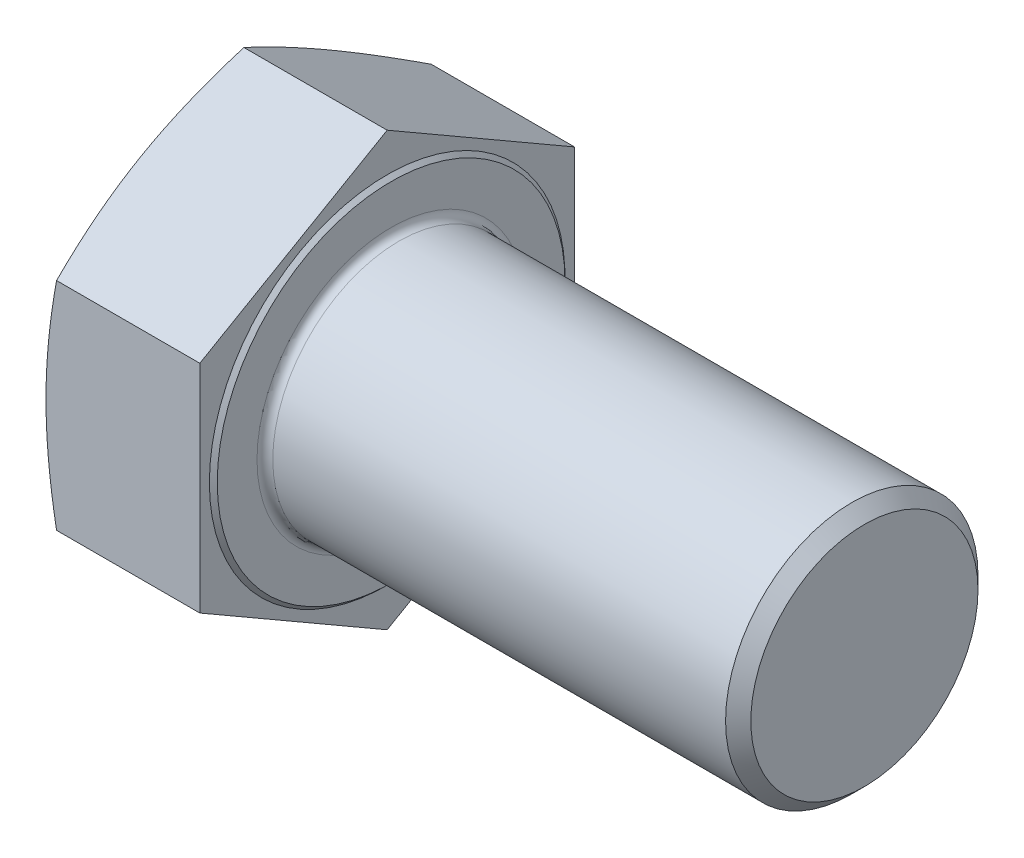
ISO-10303-21;
HEADER;
FILE_DESCRIPTION(('STEP AP214'),'2;1');
FILE_NAME('part.step','',(''),(''),'','','');
FILE_SCHEMA(('AUTOMOTIVE_DESIGN { 1 0 10303 214 1 1 1 1 }'));
ENDSEC;
DATA;
#1=APPLICATION_CONTEXT('core data for automotive mechanical design processes');
#2=APPLICATION_PROTOCOL_DEFINITION('international standard','automotive_design',2000,#1);
#3=PRODUCT_CONTEXT('',#1,'mechanical');
#4=PRODUCT('Part','Part','',(#3));
#5=PRODUCT_RELATED_PRODUCT_CATEGORY('part','',(#4));
#6=PRODUCT_DEFINITION_FORMATION('','',#4);
#7=PRODUCT_DEFINITION_CONTEXT('part definition',#1,'design');
#8=PRODUCT_DEFINITION('design','',#6,#7);
#9=PRODUCT_DEFINITION_SHAPE('','',#8);
#10=(LENGTH_UNIT() NAMED_UNIT(*) SI_UNIT(.MILLI.,.METRE.));
#11=(NAMED_UNIT(*) PLANE_ANGLE_UNIT() SI_UNIT($,.RADIAN.));
#12=(NAMED_UNIT(*) SI_UNIT($,.STERADIAN.) SOLID_ANGLE_UNIT());
#13=UNCERTAINTY_MEASURE_WITH_UNIT(LENGTH_MEASURE(1.E-05),#10,'distance_accuracy_value','');
#14=(GEOMETRIC_REPRESENTATION_CONTEXT(3) GLOBAL_UNCERTAINTY_ASSIGNED_CONTEXT((#13)) GLOBAL_UNIT_ASSIGNED_CONTEXT((#10,
#11,#12)) REPRESENTATION_CONTEXT('',''));
#15=CARTESIAN_POINT('',(0.,0.,0.));
#16=DIRECTION('',(0.,0.,1.));
#17=DIRECTION('',(1.,0.,0.));
#18=AXIS2_PLACEMENT_3D('',#15,#16,#17);
#19=CARTESIAN_POINT('',(40.,-82.2724133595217,-47.5));
#20=DIRECTION('',(1.,0.,0.));
#21=DIRECTION('',(0.,0.,-1.));
#22=AXIS2_PLACEMENT_3D('',#19,#20,#21);
#23=PLANE('',#22);
#24=CARTESIAN_POINT('',(40.,0.,0.));
#25=DIRECTION('',(1.,0.,0.));
#26=DIRECTION('',(0.,0.,-1.));
#27=AXIS2_PLACEMENT_3D('',#24,#25,#26);
#28=CIRCLE('',#27,34.);
#29=CARTESIAN_POINT('',(40.,0.,-34.));
#30=VERTEX_POINT('',#29);
#31=EDGE_CURVE('E11',#30,#30,#28,.F.);
#32=ORIENTED_EDGE('',*,*,#31,.T.);
#33=EDGE_LOOP('',(#32));
#34=FACE_BOUND('',#33,.T.);
#35=CARTESIAN_POINT('',(40.,0.,0.));
#36=DIRECTION('',(-1.,0.,0.));
#37=DIRECTION('',(0.,0.,1.));
#38=AXIS2_PLACEMENT_3D('',#35,#36,#37);
#39=CIRCLE('',#38,44.08);
#40=CARTESIAN_POINT('',(40.,0.,44.08));
#41=VERTEX_POINT('',#40);
#42=EDGE_CURVE('E257',#41,#41,#39,.T.);
#43=ORIENTED_EDGE('',*,*,#42,.F.);
#44=EDGE_LOOP('',(#43));
#45=FACE_BOUND('',#44,.T.);
#46=ADVANCED_FACE('F32',(#34,#45),#23,.T.);
#47=CARTESIAN_POINT('',(40.,-27.4241377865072,47.5));
#48=DIRECTION('',(0.,0.866025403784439,-0.5));
#49=DIRECTION('',(0.,0.5,0.866025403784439));
#50=AXIS2_PLACEMENT_3D('',#47,#48,#49);
#51=PLANE('',#50);
#52=CARTESIAN_POINT('',(2.67459560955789,-54.8483910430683,-0.000199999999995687));
#53=CARTESIAN_POINT('',(2.46789812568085,-54.2804811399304,0.983448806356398));
#54=CARTESIAN_POINT('',(2.27050260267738,-53.7117047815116,1.96859835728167));
#55=CARTESIAN_POINT('',(1.89634764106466,-52.5724052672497,3.94192300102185));
#56=CARTESIAN_POINT('',(1.71959016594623,-52.0018819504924,4.93009837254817));
#57=CARTESIAN_POINT('',(1.38865728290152,-50.8587464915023,6.91006706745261));
#58=CARTESIAN_POINT('',(1.2344992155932,-50.2861330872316,7.90186257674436));
#59=CARTESIAN_POINT('',(0.950972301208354,-49.1393836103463,9.88809093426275));
#60=CARTESIAN_POINT('',(0.821602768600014,-48.5652475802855,10.882523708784));
#61=CARTESIAN_POINT('',(0.590651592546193,-47.4210419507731,12.8643459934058));
#62=CARTESIAN_POINT('',(0.488819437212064,-46.8509850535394,13.8517135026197));
#63=CARTESIAN_POINT('',(0.31296658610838,-45.7097910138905,15.8283195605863));
#64=CARTESIAN_POINT('',(0.238946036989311,-45.1386538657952,16.8175581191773));
#65=CARTESIAN_POINT('',(0.120003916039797,-43.9958275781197,18.7969913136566));
#66=CARTESIAN_POINT('',(0.0750717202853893,-43.4241387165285,19.7871854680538));
#67=CARTESIAN_POINT('',(0.0150698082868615,-42.2803687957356,21.7682530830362));
#68=CARTESIAN_POINT('',(0.,-41.7082877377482,22.7591265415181));
#69=CARTESIAN_POINT('',(0.,-40.5641256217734,24.7408734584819));
#70=CARTESIAN_POINT('',(0.0150698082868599,-39.992044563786,25.7317469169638));
#71=CARTESIAN_POINT('',(0.0750717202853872,-38.8482746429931,27.7128145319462));
#72=CARTESIAN_POINT('',(0.120003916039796,-38.2765857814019,28.7030086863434));
#73=CARTESIAN_POINT('',(0.238946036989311,-37.1337594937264,30.6824418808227));
#74=CARTESIAN_POINT('',(0.312966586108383,-36.5626223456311,31.6716804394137));
#75=CARTESIAN_POINT('',(0.488819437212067,-35.4214283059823,33.6482864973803));
#76=CARTESIAN_POINT('',(0.590651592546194,-34.8513714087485,34.6356540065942));
#77=CARTESIAN_POINT('',(0.821602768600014,-33.7071657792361,36.617476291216));
#78=CARTESIAN_POINT('',(0.950972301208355,-33.1330297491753,37.6119090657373));
#79=CARTESIAN_POINT('',(1.2344992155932,-31.98628027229,39.5981374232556));
#80=CARTESIAN_POINT('',(1.38865728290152,-31.4136668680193,40.5899329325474));
#81=CARTESIAN_POINT('',(1.71959016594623,-30.2705314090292,42.5699016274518));
#82=CARTESIAN_POINT('',(1.89634764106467,-29.7000080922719,43.5580769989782));
#83=CARTESIAN_POINT('',(2.27050260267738,-28.56070857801,45.5314016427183));
#84=CARTESIAN_POINT('',(2.46789812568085,-27.9919322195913,46.5165511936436));
#85=CARTESIAN_POINT('',(2.67459560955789,-27.4240223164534,47.5002));
#86=B_SPLINE_CURVE_WITH_KNOTS('',3,(#52,#53,#54,#55,#56,#57,#58,#59,#60,#61,#62,#63,#64,#65,#66,
#67,#68,#69,#70,#71,#72,#73,#74,#75,#76,#77,#78,#79,#80,#81,#82,#83,#84,#85),.UNSPECIFIED.,.F.,
.F.,(4,2,2,2,2,2,2,2,2,2,2,2,2,2,2,2,4),(0.,3.46344234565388,6.92721393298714,10.3936295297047,
13.8599492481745,17.2935848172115,20.7272384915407,24.1596373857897,27.5920257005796,
31.0244140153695,34.4568129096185,37.8904665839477,41.3241021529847,44.7904218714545,
48.256837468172,51.7206090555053,55.1840514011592),.UNSPECIFIED.);
#87=CARTESIAN_POINT('',(2.67455358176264,-54.8482755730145,0.));
#88=VERTEX_POINT('',#87);
#89=CARTESIAN_POINT('',(0.,-41.1362066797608,23.75));
#90=VERTEX_POINT('',#89);
#91=EDGE_CURVE('E276',#88,#90,#86,.T.);
#92=ORIENTED_EDGE('',*,*,#91,.F.);
#93=DIRECTION('',(-1.,0.,0.));
#94=VECTOR('',#93,1.);
#95=CARTESIAN_POINT('',(40.,-54.8482755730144,0.));
#96=LINE('',#95,#94);
#97=CARTESIAN_POINT('',(39.,-54.8482755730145,0.));
#98=VERTEX_POINT('',#97);
#99=EDGE_CURVE('E142',#98,#88,#96,.T.);
#100=ORIENTED_EDGE('',*,*,#99,.F.);
#101=DIRECTION('',(0.,-0.5,-0.866025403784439));
#102=VECTOR('',#101,1.);
#103=CARTESIAN_POINT('',(39.,-27.4241377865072,47.5));
#104=LINE('',#103,#102);
#105=CARTESIAN_POINT('',(39.,-27.4241377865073,47.5));
#106=VERTEX_POINT('',#105);
#107=EDGE_CURVE('E133',#106,#98,#104,.T.);
#108=ORIENTED_EDGE('',*,*,#107,.F.);
#109=DIRECTION('',(-1.,0.,0.));
#110=VECTOR('',#109,1.);
#111=CARTESIAN_POINT('',(40.,-27.4241377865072,47.5));
#112=LINE('',#111,#110);
#113=CARTESIAN_POINT('',(2.67455358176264,-27.4241377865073,47.5));
#114=VERTEX_POINT('',#113);
#115=EDGE_CURVE('E128',#106,#114,#112,.T.);
#116=ORIENTED_EDGE('',*,*,#115,.T.);
#117=EDGE_CURVE('E121',#90,#114,#86,.T.);
#118=ORIENTED_EDGE('',*,*,#117,.F.);
#119=EDGE_LOOP('',(#92,#100,#108,#116,#118));
#120=FACE_BOUND('',#119,.T.);
#121=ADVANCED_FACE('F34',(#120),#51,.F.);
#122=CARTESIAN_POINT('',(40.,-54.8482755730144,0.));
#123=DIRECTION('',(0.,0.866025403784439,0.5));
#124=DIRECTION('',(0.,-0.5,0.866025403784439));
#125=AXIS2_PLACEMENT_3D('',#122,#123,#124);
#126=PLANE('',#125);
#127=CARTESIAN_POINT('',(2.6745956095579,-27.4240223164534,-47.5002));
#128=CARTESIAN_POINT('',(2.46789812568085,-27.9919322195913,-46.5165511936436));
#129=CARTESIAN_POINT('',(2.27050260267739,-28.5607085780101,-45.5314016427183));
#130=CARTESIAN_POINT('',(1.89634764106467,-29.700008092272,-43.5580769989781));
#131=CARTESIAN_POINT('',(1.71959016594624,-30.2705314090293,-42.5699016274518));
#132=CARTESIAN_POINT('',(1.38865728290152,-31.4136668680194,-40.5899329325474));
#133=CARTESIAN_POINT('',(1.2344992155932,-31.98628027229,-39.5981374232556));
#134=CARTESIAN_POINT('',(0.950972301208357,-33.1330297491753,-37.6119090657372));
#135=CARTESIAN_POINT('',(0.821602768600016,-33.7071657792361,-36.617476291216));
#136=CARTESIAN_POINT('',(0.590651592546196,-34.8513714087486,-34.6356540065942));
#137=CARTESIAN_POINT('',(0.488819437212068,-35.4214283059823,-33.6482864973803));
#138=CARTESIAN_POINT('',(0.312966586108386,-36.5626223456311,-31.6716804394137));
#139=CARTESIAN_POINT('',(0.238946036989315,-37.1337594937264,-30.6824418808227));
#140=CARTESIAN_POINT('',(0.1200039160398,-38.2765857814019,-28.7030086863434));
#141=CARTESIAN_POINT('',(0.0750717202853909,-38.8482746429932,-27.7128145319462));
#142=CARTESIAN_POINT('',(0.0150698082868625,-39.992044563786,-25.7317469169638));
#143=CARTESIAN_POINT('',(0.,-40.5641256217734,-24.7408734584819));
#144=CARTESIAN_POINT('',(0.,-41.7082877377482,-22.7591265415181));
#145=CARTESIAN_POINT('',(0.0150698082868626,-42.2803687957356,-21.7682530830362));
#146=CARTESIAN_POINT('',(0.0750717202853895,-43.4241387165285,-19.7871854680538));
#147=CARTESIAN_POINT('',(0.120003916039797,-43.9958275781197,-18.7969913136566));
#148=CARTESIAN_POINT('',(0.238946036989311,-45.1386538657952,-16.8175581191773));
#149=CARTESIAN_POINT('',(0.312966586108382,-45.7097910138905,-15.8283195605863));
#150=CARTESIAN_POINT('',(0.488819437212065,-46.8509850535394,-13.8517135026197));
#151=CARTESIAN_POINT('',(0.590651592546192,-47.4210419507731,-12.8643459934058));
#152=CARTESIAN_POINT('',(0.82160276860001,-48.5652475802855,-10.882523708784));
#153=CARTESIAN_POINT('',(0.950972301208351,-49.1393836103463,-9.88809093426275));
#154=CARTESIAN_POINT('',(1.23449921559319,-50.2861330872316,-7.90186257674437));
#155=CARTESIAN_POINT('',(1.38865728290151,-50.8587464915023,-6.91006706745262));
#156=CARTESIAN_POINT('',(1.71959016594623,-52.0018819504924,-4.93009837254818));
#157=CARTESIAN_POINT('',(1.89634764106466,-52.5724052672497,-3.94192300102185));
#158=CARTESIAN_POINT('',(2.27050260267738,-53.7117047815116,-1.96859835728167));
#159=CARTESIAN_POINT('',(2.46789812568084,-54.2804811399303,-0.983448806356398));
#160=CARTESIAN_POINT('',(2.67459560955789,-54.8483910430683,0.000199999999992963));
#161=B_SPLINE_CURVE_WITH_KNOTS('',3,(#127,#128,#129,#130,#131,#132,#133,#134,#135,#136,#137,
#138,#139,#140,#141,#142,#143,#144,#145,#146,#147,#148,#149,#150,#151,#152,#153,#154,#155,#156,
#157,#158,#159,#160),.UNSPECIFIED.,.F.,.F.,(4,2,2,2,2,2,2,2,2,2,2,2,2,2,2,2,4),(0.,
3.46344234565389,6.92721393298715,10.3936295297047,13.8599492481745,17.2935848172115,
20.7272384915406,24.1596373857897,27.5920257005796,31.0244140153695,34.4568129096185,
37.8904665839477,41.3241021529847,44.7904218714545,48.256837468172,51.7206090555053,
55.1840514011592),.UNSPECIFIED.);
#162=CARTESIAN_POINT('',(2.67455358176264,-27.4241377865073,-47.5));
#163=VERTEX_POINT('',#162);
#164=CARTESIAN_POINT('',(0.,-41.1362066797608,-23.75));
#165=VERTEX_POINT('',#164);
#166=EDGE_CURVE('E229',#163,#165,#161,.T.);
#167=ORIENTED_EDGE('',*,*,#166,.F.);
#168=DIRECTION('',(-1.,0.,0.));
#169=VECTOR('',#168,1.);
#170=CARTESIAN_POINT('',(40.,-27.4241377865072,-47.5));
#171=LINE('',#170,#169);
#172=CARTESIAN_POINT('',(39.,-27.4241377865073,-47.5));
#173=VERTEX_POINT('',#172);
#174=EDGE_CURVE('E139',#173,#163,#171,.T.);
#175=ORIENTED_EDGE('',*,*,#174,.F.);
#176=DIRECTION('',(0.,0.5,-0.866025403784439));
#177=VECTOR('',#176,1.);
#178=CARTESIAN_POINT('',(39.,-54.8482755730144,0.));
#179=LINE('',#178,#177);
#180=EDGE_CURVE('E266',#98,#173,#179,.T.);
#181=ORIENTED_EDGE('',*,*,#180,.F.);
#182=ORIENTED_EDGE('',*,*,#99,.T.);
#183=EDGE_CURVE('E225',#165,#88,#161,.T.);
#184=ORIENTED_EDGE('',*,*,#183,.F.);
#185=EDGE_LOOP('',(#167,#175,#181,#182,#184));
#186=FACE_BOUND('',#185,.T.);
#187=ADVANCED_FACE('F180',(#186),#126,.F.);
#188=CARTESIAN_POINT('',(40.,-27.4241377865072,-47.5));
#189=DIRECTION('',(0.,0.,1.));
#190=DIRECTION('',(0.,-1.,0.));
#191=AXIS2_PLACEMENT_3D('',#188,#189,#190);
#192=PLANE('',#191);
#193=CARTESIAN_POINT('',(14.2917536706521,-72.609473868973,-47.5));
#194=CARTESIAN_POINT('',(13.9644810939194,-71.5349542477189,-47.5));
#195=CARTESIAN_POINT('',(13.6391829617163,-70.4598313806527,-47.5));
#196=CARTESIAN_POINT('',(12.9929882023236,-68.3082572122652,-47.5));
#197=CARTESIAN_POINT('',(12.6720916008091,-67.2318059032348,-47.5));
#198=CARTESIAN_POINT('',(12.0351315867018,-65.0773816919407,-47.5));
#199=CARTESIAN_POINT('',(11.7190685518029,-63.9994086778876,-47.5));
#200=CARTESIAN_POINT('',(11.0923375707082,-61.8418982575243,-47.5));
#201=CARTESIAN_POINT('',(10.7816696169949,-60.7623608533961,-47.5));
#202=CARTESIAN_POINT('',(9.85747603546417,-57.5171579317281,-47.5));
#203=CARTESIAN_POINT('',(9.25295184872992,-55.3489151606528,-47.5));
#204=CARTESIAN_POINT('',(8.07364144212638,-51.004372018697,-47.5));
#205=CARTESIAN_POINT('',(7.49885468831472,-48.8280717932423,-47.5));
#206=CARTESIAN_POINT('',(6.39326653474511,-44.4928457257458,-47.5));
#207=CARTESIAN_POINT('',(5.86201019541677,-42.3340364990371,-47.5));
#208=CARTESIAN_POINT('',(4.84472633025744,-38.0056776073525,-47.5));
#209=CARTESIAN_POINT('',(4.35869956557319,-35.8361277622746,-47.5));
#210=CARTESIAN_POINT('',(3.44320866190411,-31.4857942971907,-47.5));
#211=CARTESIAN_POINT('',(3.01372522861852,-29.3050147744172,-47.5));
#212=CARTESIAN_POINT('',(2.22439409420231,-24.9308159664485,-47.5));
#213=CARTESIAN_POINT('',(1.86454405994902,-22.737397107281,-47.5));
#214=CARTESIAN_POINT('',(1.26474387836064,-18.5848116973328,-47.5));
#215=CARTESIAN_POINT('',(1.01587422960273,-16.6269537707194,-47.5));
#216=CARTESIAN_POINT('',(0.699882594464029,-13.6840760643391,-47.5));
#217=CARTESIAN_POINT('',(0.604103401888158,-12.7020901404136,-47.5));
#218=CARTESIAN_POINT('',(0.432723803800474,-10.7363426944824,-47.5));
#219=CARTESIAN_POINT('',(0.357123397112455,-9.75258117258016,-47.5));
#220=CARTESIAN_POINT('',(0.22708251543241,-7.78434865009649,-47.5));
#221=CARTESIAN_POINT('',(0.172627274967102,-6.79987862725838,-47.5));
#222=CARTESIAN_POINT('',(0.0855050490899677,-4.82997097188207,-47.5));
#223=CARTESIAN_POINT('',(0.0528380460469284,-3.8445333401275,-47.5));
#224=CARTESIAN_POINT('',(0.00973154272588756,-1.87317368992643,-47.5));
#225=CARTESIAN_POINT('',(-0.000708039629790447,-0.887251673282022,-47.5));
#226=CARTESIAN_POINT('',(0.000782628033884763,1.08457560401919,-47.5));
#227=CARTESIAN_POINT('',(0.0127128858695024,2.07048086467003,-47.5));
#228=CARTESIAN_POINT('',(0.0588972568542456,4.04676622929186,-47.5));
#229=CARTESIAN_POINT('',(0.0932642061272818,5.03714368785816,-47.5));
#230=CARTESIAN_POINT('',(0.183965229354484,7.01688740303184,-47.5));
#231=CARTESIAN_POINT('',(0.240299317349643,8.00625365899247,-47.5));
#232=CARTESIAN_POINT('',(0.374203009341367,9.98356021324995,-47.5));
#233=CARTESIAN_POINT('',(0.451772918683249,10.9715004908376,-47.5));
#234=CARTESIAN_POINT('',(0.627184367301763,12.9455599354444,-47.5));
#235=CARTESIAN_POINT('',(0.725025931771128,13.9316791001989,-47.5));
#236=CARTESIAN_POINT('',(1.0474838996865,16.8885587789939,-47.5));
#237=CARTESIAN_POINT('',(1.30092205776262,18.8562442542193,-47.5));
#238=CARTESIAN_POINT('',(1.73104906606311,21.8002454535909,-47.5));
#239=CARTESIAN_POINT('',(1.88275591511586,22.780340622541,-47.5));
#240=CARTESIAN_POINT('',(2.20151918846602,24.7380474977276,-47.5));
#241=CARTESIAN_POINT('',(2.36857571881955,25.7156591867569,-47.5));
#242=CARTESIAN_POINT('',(2.90923921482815,28.7479678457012,-47.5));
#243=CARTESIAN_POINT('',(3.30698744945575,30.7983780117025,-47.5));
#244=CARTESIAN_POINT('',(4.15366697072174,34.8886319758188,-47.5));
#245=CARTESIAN_POINT('',(4.6026021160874,36.9284749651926,-47.5));
#246=CARTESIAN_POINT('',(5.54223962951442,40.9990953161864,-47.5));
#247=CARTESIAN_POINT('',(6.03295412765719,43.0298698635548,-47.5));
#248=CARTESIAN_POINT('',(7.04816495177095,47.0828615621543,-47.5));
#249=CARTESIAN_POINT('',(7.5726604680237,49.1050789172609,-47.5));
#250=CARTESIAN_POINT('',(8.64981077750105,53.1447558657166,-47.5));
#251=CARTESIAN_POINT('',(9.20250086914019,55.1622060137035,-47.5));
#252=CARTESIAN_POINT('',(10.3303638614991,59.1908031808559,-47.5));
#253=CARTESIAN_POINT('',(10.9055368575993,61.2019501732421,-47.5));
#254=CARTESIAN_POINT('',(12.074250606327,65.2185225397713,-47.5));
#255=CARTESIAN_POINT('',(12.6677882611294,67.2239488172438,-47.5));
#256=CARTESIAN_POINT('',(13.870132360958,71.2302065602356,-47.5));
#257=CARTESIAN_POINT('',(14.4789387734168,73.2310380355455,-47.5));
#258=CARTESIAN_POINT('',(15.7024853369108,77.2067106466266,-47.5));
#259=CARTESIAN_POINT('',(16.3170857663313,79.1815948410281,-47.5));
#260=CARTESIAN_POINT('',(17.5567558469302,83.1280715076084,-47.5));
#261=CARTESIAN_POINT('',(18.1818254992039,85.0996639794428,-47.5));
#262=CARTESIAN_POINT('',(19.4408617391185,89.0401033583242,-47.5));
#263=CARTESIAN_POINT('',(20.0748287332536,91.0089501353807,-47.5));
#264=CARTESIAN_POINT('',(21.3503275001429,94.9441922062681,-47.5));
#265=CARTESIAN_POINT('',(21.9918592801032,96.9105874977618,-47.5));
#266=CARTESIAN_POINT('',(23.2789683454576,100.833786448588,-47.5));
#267=CARTESIAN_POINT('',(23.9245210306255,102.790598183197,-47.5));
#268=CARTESIAN_POINT('',(25.2211970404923,106.702375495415,-47.5));
#269=CARTESIAN_POINT('',(25.8723203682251,108.657341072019,-47.5));
#270=CARTESIAN_POINT('',(27.1793499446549,112.565494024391,-47.5));
#271=CARTESIAN_POINT('',(27.8352557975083,114.518681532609,-47.5));
#272=CARTESIAN_POINT('',(29.1513116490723,118.423621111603,-47.5));
#273=CARTESIAN_POINT('',(29.8114616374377,120.375373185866,-47.5));
#274=CARTESIAN_POINT('',(30.4734395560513,122.32650357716,-47.5));
#275=B_SPLINE_CURVE_WITH_KNOTS('',3,(#193,#194,#195,#196,#197,#198,#199,#200,#201,#202,#203,
#204,#205,#206,#207,#208,#209,#210,#211,#212,#213,#214,#215,#216,#217,#218,#219,#220,#221,#222,
#223,#224,#225,#226,#227,#228,#229,#230,#231,#232,#233,#234,#235,#236,#237,#238,#239,#240,#241,
#242,#243,#244,#245,#246,#247,#248,#249,#250,#251,#252,#253,#254,#255,#256,#257,#258,#259,#260,
#261,#262,#263,#264,#265,#266,#267,#268,#269,#270,#271,#272,#273,#274),.UNSPECIFIED.,.F.,.F.,(4,
2,2,2,2,2,2,2,2,2,2,2,2,2,2,2,2,2,2,2,2,2,2,2,2,2,2,2,2,2,2,2,2,2,2,2,2,2,2,2,4),(0.,
3.36976291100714,6.73954547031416,10.1095900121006,13.4796298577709,20.2322684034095,
26.9847856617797,33.654047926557,40.3234224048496,46.9905151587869,53.6573844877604,
59.5767707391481,62.5365332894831,65.4962956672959,68.4539875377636,71.4116770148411,
74.3693555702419,77.3270351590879,80.299704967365,83.2723766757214,86.2450911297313,
89.2178092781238,95.168045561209,98.1432608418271,101.118496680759,107.383502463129,
113.648980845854,119.916284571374,126.183438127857,132.458640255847,138.73386900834,
145.00804493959,151.282207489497,157.487099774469,163.69199270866,169.897170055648,
176.102353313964,182.283982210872,188.465614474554,194.646740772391,200.827852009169),.UNSPECIFIED.);
#276=CARTESIAN_POINT('',(2.67455358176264,27.4241377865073,-47.5));
#277=VERTEX_POINT('',#276);
#278=CARTESIAN_POINT('',(0.,0.,-47.5));
#279=VERTEX_POINT('',#278);
#280=EDGE_CURVE('E292',#277,#279,#275,.F.);
#281=ORIENTED_EDGE('',*,*,#280,.F.);
#282=DIRECTION('',(-1.,0.,0.));
#283=VECTOR('',#282,1.);
#284=CARTESIAN_POINT('',(40.,27.4241377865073,-47.5));
#285=LINE('',#284,#283);
#286=CARTESIAN_POINT('',(39.,27.4241377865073,-47.5));
#287=VERTEX_POINT('',#286);
#288=EDGE_CURVE('E130',#287,#277,#285,.T.);
#289=ORIENTED_EDGE('',*,*,#288,.F.);
#290=DIRECTION('',(0.,1.,0.));
#291=VECTOR('',#290,1.);
#292=CARTESIAN_POINT('',(39.,-27.4241377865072,-47.5));
#293=LINE('',#292,#291);
#294=EDGE_CURVE('E259',#173,#287,#293,.T.);
#295=ORIENTED_EDGE('',*,*,#294,.F.);
#296=ORIENTED_EDGE('',*,*,#174,.T.);
#297=EDGE_CURVE('E230',#279,#163,#275,.F.);
#298=ORIENTED_EDGE('',*,*,#297,.F.);
#299=EDGE_LOOP('',(#281,#289,#295,#296,#298));
#300=FACE_BOUND('',#299,.T.);
#301=ADVANCED_FACE('F238',(#300),#192,.F.);
#302=CARTESIAN_POINT('',(40.,27.4241377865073,-47.5));
#303=DIRECTION('',(0.,-0.866025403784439,0.5));
#304=DIRECTION('',(0.,-0.5,-0.866025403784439));
#305=AXIS2_PLACEMENT_3D('',#302,#303,#304);
#306=PLANE('',#305);
#307=CARTESIAN_POINT('',(2.67459560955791,54.8483910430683,0.000199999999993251));
#308=CARTESIAN_POINT('',(2.46789812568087,54.2804811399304,-0.983448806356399));
#309=CARTESIAN_POINT('',(2.2705026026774,53.7117047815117,-1.96859835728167));
#310=CARTESIAN_POINT('',(1.89634764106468,52.5724052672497,-3.94192300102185));
#311=CARTESIAN_POINT('',(1.71959016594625,52.0018819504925,-4.93009837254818));
#312=CARTESIAN_POINT('',(1.38865728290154,50.8587464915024,-6.91006706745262));
#313=CARTESIAN_POINT('',(1.23449921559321,50.2861330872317,-7.90186257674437));
#314=CARTESIAN_POINT('',(0.950972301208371,49.1393836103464,-9.88809093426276));
#315=CARTESIAN_POINT('',(0.821602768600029,48.5652475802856,-10.882523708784));
#316=CARTESIAN_POINT('',(0.59065159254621,47.4210419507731,-12.8643459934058));
#317=CARTESIAN_POINT('',(0.488819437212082,46.8509850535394,-13.8517135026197));
#318=CARTESIAN_POINT('',(0.312966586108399,45.7097910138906,-15.8283195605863));
#319=CARTESIAN_POINT('',(0.238946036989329,45.1386538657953,-16.8175581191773));
#320=CARTESIAN_POINT('',(0.120003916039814,43.9958275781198,-18.7969913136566));
#321=CARTESIAN_POINT('',(0.0750717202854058,43.4241387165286,-19.7871854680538));
#322=CARTESIAN_POINT('',(0.0150698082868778,42.2803687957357,-21.7682530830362));
#323=CARTESIAN_POINT('',(0.,41.7082877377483,-22.7591265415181));
#324=CARTESIAN_POINT('',(0.,40.5641256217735,-24.7408734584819));
#325=CARTESIAN_POINT('',(0.0150698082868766,39.9920445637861,-25.7317469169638));
#326=CARTESIAN_POINT('',(0.0750717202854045,38.8482746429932,-27.7128145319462));
#327=CARTESIAN_POINT('',(0.120003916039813,38.276585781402,-28.7030086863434));
#328=CARTESIAN_POINT('',(0.238946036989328,37.1337594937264,-30.6824418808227));
#329=CARTESIAN_POINT('',(0.312966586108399,36.5626223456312,-31.6716804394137));
#330=CARTESIAN_POINT('',(0.488819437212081,35.4214283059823,-33.6482864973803));
#331=CARTESIAN_POINT('',(0.590651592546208,34.8513714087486,-34.6356540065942));
#332=CARTESIAN_POINT('',(0.821602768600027,33.7071657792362,-36.617476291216));
#333=CARTESIAN_POINT('',(0.950972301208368,33.1330297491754,-37.6119090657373));
#334=CARTESIAN_POINT('',(1.23449921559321,31.98628027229,-39.5981374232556));
#335=CARTESIAN_POINT('',(1.38865728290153,31.4136668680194,-40.5899329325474));
#336=CARTESIAN_POINT('',(1.71959016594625,30.2705314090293,-42.5699016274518));
#337=CARTESIAN_POINT('',(1.89634764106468,29.700008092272,-43.5580769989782));
#338=CARTESIAN_POINT('',(2.27050260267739,28.5607085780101,-45.5314016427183));
#339=CARTESIAN_POINT('',(2.46789812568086,27.9919322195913,-46.5165511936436));
#340=CARTESIAN_POINT('',(2.6745956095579,27.4240223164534,-47.5002));
#341=B_SPLINE_CURVE_WITH_KNOTS('',3,(#307,#308,#309,#310,#311,#312,#313,#314,#315,#316,#317,
#318,#319,#320,#321,#322,#323,#324,#325,#326,#327,#328,#329,#330,#331,#332,#333,#334,#335,#336,
#337,#338,#339,#340),.UNSPECIFIED.,.F.,.F.,(4,2,2,2,2,2,2,2,2,2,2,2,2,2,2,2,4),(0.,
3.46344234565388,6.92721393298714,10.3936295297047,13.8599492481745,17.2935848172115,
20.7272384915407,24.1596373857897,27.5920257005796,31.0244140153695,34.4568129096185,
37.8904665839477,41.3241021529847,44.7904218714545,48.256837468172,51.7206090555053,
55.1840514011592),.UNSPECIFIED.);
#342=CARTESIAN_POINT('',(2.67455358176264,54.8482755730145,0.));
#343=VERTEX_POINT('',#342);
#344=CARTESIAN_POINT('',(0.,41.1362066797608,-23.75));
#345=VERTEX_POINT('',#344);
#346=EDGE_CURVE('E48',#343,#345,#341,.T.);
#347=ORIENTED_EDGE('',*,*,#346,.F.);
#348=DIRECTION('',(-1.,0.,0.));
#349=VECTOR('',#348,1.);
#350=CARTESIAN_POINT('',(40.,54.8482755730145,0.));
#351=LINE('',#350,#349);
#352=CARTESIAN_POINT('',(39.,54.8482755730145,0.));
#353=VERTEX_POINT('',#352);
#354=EDGE_CURVE('E127',#353,#343,#351,.T.);
#355=ORIENTED_EDGE('',*,*,#354,.F.);
#356=DIRECTION('',(0.,0.5,0.866025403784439));
#357=VECTOR('',#356,1.);
#358=CARTESIAN_POINT('',(39.,27.4241377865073,-47.5));
#359=LINE('',#358,#357);
#360=EDGE_CURVE('E256',#287,#353,#359,.T.);
#361=ORIENTED_EDGE('',*,*,#360,.F.);
#362=ORIENTED_EDGE('',*,*,#288,.T.);
#363=EDGE_CURVE('E253',#345,#277,#341,.T.);
#364=ORIENTED_EDGE('',*,*,#363,.F.);
#365=EDGE_LOOP('',(#347,#355,#361,#362,#364));
#366=FACE_BOUND('',#365,.T.);
#367=ADVANCED_FACE('F242',(#366),#306,.F.);
#368=CARTESIAN_POINT('',(40.,54.8482755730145,0.));
#369=DIRECTION('',(0.,-0.866025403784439,-0.5));
#370=DIRECTION('',(0.,0.5,-0.866025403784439));
#371=AXIS2_PLACEMENT_3D('',#368,#369,#370);
#372=PLANE('',#371);
#373=CARTESIAN_POINT('',(2.67459560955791,27.4240223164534,47.5002));
#374=CARTESIAN_POINT('',(2.46789812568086,27.9919322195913,46.5165511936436));
#375=CARTESIAN_POINT('',(2.2705026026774,28.5607085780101,45.5314016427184));
#376=CARTESIAN_POINT('',(1.89634764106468,29.700008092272,43.5580769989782));
#377=CARTESIAN_POINT('',(1.71959016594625,30.2705314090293,42.5699016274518));
#378=CARTESIAN_POINT('',(1.38865728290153,31.4136668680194,40.5899329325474));
#379=CARTESIAN_POINT('',(1.23449921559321,31.98628027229,39.5981374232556));
#380=CARTESIAN_POINT('',(0.950972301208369,33.1330297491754,37.6119090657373));
#381=CARTESIAN_POINT('',(0.821602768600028,33.7071657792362,36.617476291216));
#382=CARTESIAN_POINT('',(0.590651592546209,34.8513714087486,34.6356540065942));
#383=CARTESIAN_POINT('',(0.488819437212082,35.4214283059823,33.6482864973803));
#384=CARTESIAN_POINT('',(0.3129665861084,36.5626223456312,31.6716804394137));
#385=CARTESIAN_POINT('',(0.23894603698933,37.1337594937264,30.6824418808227));
#386=CARTESIAN_POINT('',(0.120003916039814,38.276585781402,28.7030086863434));
#387=CARTESIAN_POINT('',(0.0750717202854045,38.8482746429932,27.7128145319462));
#388=CARTESIAN_POINT('',(0.0150698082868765,39.9920445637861,25.7317469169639));
#389=CARTESIAN_POINT('',(0.,40.5641256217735,24.7408734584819));
#390=CARTESIAN_POINT('',(0.,41.7082877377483,22.7591265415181));
#391=CARTESIAN_POINT('',(0.0150698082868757,42.2803687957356,21.7682530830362));
#392=CARTESIAN_POINT('',(0.0750717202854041,43.4241387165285,19.7871854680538));
#393=CARTESIAN_POINT('',(0.120003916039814,43.9958275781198,18.7969913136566));
#394=CARTESIAN_POINT('',(0.238946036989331,45.1386538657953,16.8175581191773));
#395=CARTESIAN_POINT('',(0.3129665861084,45.7097910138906,15.8283195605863));
#396=CARTESIAN_POINT('',(0.488819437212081,46.8509850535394,13.8517135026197));
#397=CARTESIAN_POINT('',(0.590651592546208,47.4210419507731,12.8643459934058));
#398=CARTESIAN_POINT('',(0.821602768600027,48.5652475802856,10.882523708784));
#399=CARTESIAN_POINT('',(0.950972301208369,49.1393836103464,9.88809093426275));
#400=CARTESIAN_POINT('',(1.23449921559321,50.2861330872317,7.90186257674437));
#401=CARTESIAN_POINT('',(1.38865728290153,50.8587464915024,6.91006706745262));
#402=CARTESIAN_POINT('',(1.71959016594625,52.0018819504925,4.93009837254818));
#403=CARTESIAN_POINT('',(1.89634764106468,52.5724052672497,3.94192300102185));
#404=CARTESIAN_POINT('',(2.2705026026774,53.7117047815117,1.96859835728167));
#405=CARTESIAN_POINT('',(2.46789812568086,54.2804811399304,0.983448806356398));
#406=CARTESIAN_POINT('',(2.67459560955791,54.8483910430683,-0.000199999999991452));
#407=B_SPLINE_CURVE_WITH_KNOTS('',3,(#373,#374,#375,#376,#377,#378,#379,#380,#381,#382,#383,
#384,#385,#386,#387,#388,#389,#390,#391,#392,#393,#394,#395,#396,#397,#398,#399,#400,#401,#402,
#403,#404,#405,#406),.UNSPECIFIED.,.F.,.F.,(4,2,2,2,2,2,2,2,2,2,2,2,2,2,2,2,4),(0.,
3.46344234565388,6.92721393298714,10.3936295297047,13.8599492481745,17.2935848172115,
20.7272384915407,24.1596373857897,27.5920257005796,31.0244140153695,34.4568129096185,
37.8904665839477,41.3241021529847,44.7904218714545,48.256837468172,51.7206090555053,
55.1840514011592),.UNSPECIFIED.);
#408=CARTESIAN_POINT('',(2.67455358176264,27.4241377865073,47.5));
#409=VERTEX_POINT('',#408);
#410=CARTESIAN_POINT('',(0.,41.1362066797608,23.75));
#411=VERTEX_POINT('',#410);
#412=EDGE_CURVE('E56',#409,#411,#407,.T.);
#413=ORIENTED_EDGE('',*,*,#412,.F.);
#414=DIRECTION('',(-1.,0.,0.));
#415=VECTOR('',#414,1.);
#416=CARTESIAN_POINT('',(40.,27.4241377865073,47.5));
#417=LINE('',#416,#415);
#418=CARTESIAN_POINT('',(39.,27.4241377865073,47.5));
#419=VERTEX_POINT('',#418);
#420=EDGE_CURVE('E118',#419,#409,#417,.T.);
#421=ORIENTED_EDGE('',*,*,#420,.F.);
#422=DIRECTION('',(0.,-0.5,0.866025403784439));
#423=VECTOR('',#422,1.);
#424=CARTESIAN_POINT('',(39.,54.8482755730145,0.));
#425=LINE('',#424,#423);
#426=EDGE_CURVE('E254',#353,#419,#425,.T.);
#427=ORIENTED_EDGE('',*,*,#426,.F.);
#428=ORIENTED_EDGE('',*,*,#354,.T.);
#429=EDGE_CURVE('E120',#411,#343,#407,.T.);
#430=ORIENTED_EDGE('',*,*,#429,.F.);
#431=EDGE_LOOP('',(#413,#421,#427,#428,#430));
#432=FACE_BOUND('',#431,.T.);
#433=ADVANCED_FACE('F116',(#432),#372,.F.);
#434=CARTESIAN_POINT('',(40.,27.4241377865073,47.5));
#435=DIRECTION('',(0.,0.,-1.));
#436=DIRECTION('',(-1.,0.,0.));
#437=AXIS2_PLACEMENT_3D('',#434,#435,#436);
#438=PLANE('',#437);
#439=CARTESIAN_POINT('',(14.291753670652,-72.609473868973,47.5));
#440=CARTESIAN_POINT('',(13.9644810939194,-71.5349542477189,47.5));
#441=CARTESIAN_POINT('',(13.6391829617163,-70.4598313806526,47.5));
#442=CARTESIAN_POINT('',(12.9929882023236,-68.3082572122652,47.5));
#443=CARTESIAN_POINT('',(12.6720916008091,-67.2318059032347,47.5));
#444=CARTESIAN_POINT('',(12.0351315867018,-65.0773816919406,47.5));
#445=CARTESIAN_POINT('',(11.7190685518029,-63.9994086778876,47.5));
#446=CARTESIAN_POINT('',(11.0923375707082,-61.8418982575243,47.5));
#447=CARTESIAN_POINT('',(10.7816696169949,-60.7623608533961,47.5));
#448=CARTESIAN_POINT('',(9.85747603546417,-57.5171579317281,47.5));
#449=CARTESIAN_POINT('',(9.25295184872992,-55.3489151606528,47.5));
#450=CARTESIAN_POINT('',(8.07364144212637,-51.004372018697,47.5));
#451=CARTESIAN_POINT('',(7.49885468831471,-48.8280717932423,47.5));
#452=CARTESIAN_POINT('',(6.39326653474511,-44.4928457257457,47.5));
#453=CARTESIAN_POINT('',(5.86201019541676,-42.3340364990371,47.5));
#454=CARTESIAN_POINT('',(4.84472633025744,-38.0056776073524,47.5));
#455=CARTESIAN_POINT('',(4.35869956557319,-35.8361277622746,47.5));
#456=CARTESIAN_POINT('',(3.44320866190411,-31.4857942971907,47.5));
#457=CARTESIAN_POINT('',(3.01372522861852,-29.3050147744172,47.5));
#458=CARTESIAN_POINT('',(2.22439409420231,-24.9308159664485,47.5));
#459=CARTESIAN_POINT('',(1.86454405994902,-22.737397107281,47.5));
#460=CARTESIAN_POINT('',(1.26474387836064,-18.5848116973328,47.5));
#461=CARTESIAN_POINT('',(1.01587422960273,-16.6269537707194,47.5));
#462=CARTESIAN_POINT('',(0.699882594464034,-13.6840760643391,47.5));
#463=CARTESIAN_POINT('',(0.604103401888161,-12.7020901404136,47.5));
#464=CARTESIAN_POINT('',(0.432723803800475,-10.7363426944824,47.5));
#465=CARTESIAN_POINT('',(0.357123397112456,-9.75258117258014,47.5));
#466=CARTESIAN_POINT('',(0.227082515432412,-7.78434865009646,47.5));
#467=CARTESIAN_POINT('',(0.172627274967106,-6.79987862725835,47.5));
#468=CARTESIAN_POINT('',(0.0855050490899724,-4.82997097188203,47.5));
#469=CARTESIAN_POINT('',(0.0528380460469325,-3.84453334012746,47.5));
#470=CARTESIAN_POINT('',(0.0097315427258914,-1.87317368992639,47.5));
#471=CARTESIAN_POINT('',(-0.000708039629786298,-0.887251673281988,47.5));
#472=CARTESIAN_POINT('',(0.000782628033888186,1.08457560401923,47.5));
#473=CARTESIAN_POINT('',(0.0127128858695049,2.07048086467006,47.5));
#474=CARTESIAN_POINT('',(0.0588972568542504,4.0467662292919,47.5));
#475=CARTESIAN_POINT('',(0.0932642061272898,5.0371436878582,47.5));
#476=CARTESIAN_POINT('',(0.183965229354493,7.01688740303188,47.5));
#477=CARTESIAN_POINT('',(0.240299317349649,8.00625365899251,47.5));
#478=CARTESIAN_POINT('',(0.374203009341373,9.98356021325,47.5));
#479=CARTESIAN_POINT('',(0.451772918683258,10.9715004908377,47.5));
#480=CARTESIAN_POINT('',(0.627184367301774,12.9455599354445,47.5));
#481=CARTESIAN_POINT('',(0.725025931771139,13.9316791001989,47.5));
#482=CARTESIAN_POINT('',(1.04748389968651,16.888558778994,47.5));
#483=CARTESIAN_POINT('',(1.30092205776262,18.8562442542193,47.5));
#484=CARTESIAN_POINT('',(1.73104906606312,21.8002454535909,47.5));
#485=CARTESIAN_POINT('',(1.88275591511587,22.780340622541,47.5));
#486=CARTESIAN_POINT('',(2.20151918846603,24.7380474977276,47.5));
#487=CARTESIAN_POINT('',(2.36857571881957,25.7156591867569,47.5));
#488=CARTESIAN_POINT('',(2.90923921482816,28.7479678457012,47.5));
#489=CARTESIAN_POINT('',(3.30698744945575,30.7983780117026,47.5));
#490=CARTESIAN_POINT('',(4.15366697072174,34.8886319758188,47.5));
#491=CARTESIAN_POINT('',(4.60260211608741,36.9284749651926,47.5));
#492=CARTESIAN_POINT('',(5.54223962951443,40.9990953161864,47.5));
#493=CARTESIAN_POINT('',(6.0329541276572,43.0298698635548,47.5));
#494=CARTESIAN_POINT('',(7.04816495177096,47.0828615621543,47.5));
#495=CARTESIAN_POINT('',(7.5726604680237,49.1050789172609,47.5));
#496=CARTESIAN_POINT('',(8.64981077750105,53.1447558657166,47.5));
#497=CARTESIAN_POINT('',(9.20250086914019,55.1622060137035,47.5));
#498=CARTESIAN_POINT('',(10.3303638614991,59.1908031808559,47.5));
#499=CARTESIAN_POINT('',(10.9055368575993,61.2019501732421,47.5));
#500=CARTESIAN_POINT('',(12.074250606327,65.2185225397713,47.5));
#501=CARTESIAN_POINT('',(12.6677882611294,67.2239488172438,47.5));
#502=CARTESIAN_POINT('',(13.870132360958,71.2302065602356,47.5));
#503=CARTESIAN_POINT('',(14.4789387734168,73.2310380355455,47.5));
#504=CARTESIAN_POINT('',(15.7024853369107,77.2067106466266,47.5));
#505=CARTESIAN_POINT('',(16.3170857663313,79.1815948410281,47.5));
#506=CARTESIAN_POINT('',(17.5567558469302,83.1280715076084,47.5));
#507=CARTESIAN_POINT('',(18.1818254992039,85.0996639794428,47.5));
#508=CARTESIAN_POINT('',(19.4408617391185,89.0401033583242,47.5));
#509=CARTESIAN_POINT('',(20.0748287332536,91.0089501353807,47.5));
#510=CARTESIAN_POINT('',(21.3503275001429,94.9441922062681,47.5));
#511=CARTESIAN_POINT('',(21.9918592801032,96.9105874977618,47.5));
#512=CARTESIAN_POINT('',(23.2789683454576,100.833786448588,47.5));
#513=CARTESIAN_POINT('',(23.9245210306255,102.790598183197,47.5));
#514=CARTESIAN_POINT('',(25.2211970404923,106.702375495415,47.5));
#515=CARTESIAN_POINT('',(25.8723203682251,108.657341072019,47.5));
#516=CARTESIAN_POINT('',(27.1793499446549,112.565494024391,47.5));
#517=CARTESIAN_POINT('',(27.8352557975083,114.518681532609,47.5));
#518=CARTESIAN_POINT('',(29.1513116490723,118.423621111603,47.5));
#519=CARTESIAN_POINT('',(29.8114616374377,120.375373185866,47.5));
#520=CARTESIAN_POINT('',(30.4734395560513,122.32650357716,47.5));
#521=B_SPLINE_CURVE_WITH_KNOTS('',3,(#439,#440,#441,#442,#443,#444,#445,#446,#447,#448,#449,
#450,#451,#452,#453,#454,#455,#456,#457,#458,#459,#460,#461,#462,#463,#464,#465,#466,#467,#468,
#469,#470,#471,#472,#473,#474,#475,#476,#477,#478,#479,#480,#481,#482,#483,#484,#485,#486,#487,
#488,#489,#490,#491,#492,#493,#494,#495,#496,#497,#498,#499,#500,#501,#502,#503,#504,#505,#506,
#507,#508,#509,#510,#511,#512,#513,#514,#515,#516,#517,#518,#519,#520),.UNSPECIFIED.,.F.,.F.,(4,
2,2,2,2,2,2,2,2,2,2,2,2,2,2,2,2,2,2,2,2,2,2,2,2,2,2,2,2,2,2,2,2,2,2,2,2,2,2,2,4),(0.,
3.36976291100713,6.73954547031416,10.1095900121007,13.4796298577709,20.2322684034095,
26.9847856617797,33.654047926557,40.3234224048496,46.9905151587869,53.6573844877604,
59.5767707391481,62.5365332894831,65.4962956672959,68.4539875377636,71.4116770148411,
74.3693555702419,77.3270351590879,80.2997049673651,83.2723766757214,86.2450911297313,
89.2178092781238,95.168045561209,98.1432608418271,101.118496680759,107.383502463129,
113.648980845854,119.916284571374,126.183438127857,132.458640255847,138.73386900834,
145.008044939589,151.282207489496,157.487099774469,163.69199270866,169.897170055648,
176.102353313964,182.283982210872,188.465614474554,194.646740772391,200.827852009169),.UNSPECIFIED.);
#522=CARTESIAN_POINT('',(0.,0.,47.5));
#523=VERTEX_POINT('',#522);
#524=EDGE_CURVE('E111',#114,#523,#521,.T.);
#525=ORIENTED_EDGE('',*,*,#524,.F.);
#526=ORIENTED_EDGE('',*,*,#115,.F.);
#527=DIRECTION('',(0.,-1.,0.));
#528=VECTOR('',#527,1.);
#529=CARTESIAN_POINT('',(39.,27.4241377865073,47.5));
#530=LINE('',#529,#528);
#531=EDGE_CURVE('E126',#419,#106,#530,.T.);
#532=ORIENTED_EDGE('',*,*,#531,.F.);
#533=ORIENTED_EDGE('',*,*,#420,.T.);
#534=EDGE_CURVE('E103',#523,#409,#521,.T.);
#535=ORIENTED_EDGE('',*,*,#534,.F.);
#536=EDGE_LOOP('',(#525,#526,#532,#533,#535));
#537=FACE_BOUND('',#536,.T.);
#538=ADVANCED_FACE('F124',(#537),#438,.F.);
#539=CARTESIAN_POINT('',(39.,45.08,0.));
#540=DIRECTION('',(1.,0.,0.));
#541=DIRECTION('',(0.,0.,-1.));
#542=AXIS2_PLACEMENT_3D('',#539,#540,#541);
#543=PLANE('',#542);
#544=CARTESIAN_POINT('',(39.,0.,0.));
#545=DIRECTION('',(-1.,0.,0.));
#546=DIRECTION('',(0.,0.,1.));
#547=AXIS2_PLACEMENT_3D('',#544,#545,#546);
#548=CIRCLE('',#547,45.08);
#549=CARTESIAN_POINT('',(39.,0.,45.08));
#550=VERTEX_POINT('',#549);
#551=EDGE_CURVE('E262',#550,#550,#548,.T.);
#552=ORIENTED_EDGE('',*,*,#551,.T.);
#553=EDGE_LOOP('',(#552));
#554=FACE_BOUND('',#553,.T.);
#555=ORIENTED_EDGE('',*,*,#107,.T.);
#556=ORIENTED_EDGE('',*,*,#180,.T.);
#557=ORIENTED_EDGE('',*,*,#294,.T.);
#558=ORIENTED_EDGE('',*,*,#360,.T.);
#559=ORIENTED_EDGE('',*,*,#426,.T.);
#560=ORIENTED_EDGE('',*,*,#531,.T.);
#561=EDGE_LOOP('',(#555,#556,#557,#558,#559,#560));
#562=FACE_BOUND('',#561,.T.);
#563=ADVANCED_FACE('F190',(#554,#562),#543,.T.);
#564=CARTESIAN_POINT('',(39.,0.,0.));
#565=DIRECTION('',(-1.,0.,0.));
#566=DIRECTION('',(0.,0.,1.));
#567=AXIS2_PLACEMENT_3D('',#564,#565,#566);
#568=CONICAL_SURFACE('',#567,45.08,0.785398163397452);
#569=ORIENTED_EDGE('',*,*,#42,.T.);
#570=EDGE_LOOP('',(#569));
#571=FACE_BOUND('',#570,.T.);
#572=ORIENTED_EDGE('',*,*,#551,.F.);
#573=EDGE_LOOP('',(#572));
#574=FACE_BOUND('',#573,.T.);
#575=ADVANCED_FACE('F297',(#571,#574),#568,.T.);
#576=CARTESIAN_POINT('',(0.,0.,0.));
#577=DIRECTION('',(1.,0.,0.));
#578=DIRECTION('',(0.,0.,-1.));
#579=AXIS2_PLACEMENT_3D('',#576,#577,#578);
#580=CONICAL_SURFACE('',#579,47.5,1.22173047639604);
#581=ORIENTED_EDGE('',*,*,#297,.T.);
#582=ORIENTED_EDGE('',*,*,#166,.T.);
#583=CARTESIAN_POINT('',(0.,0.,0.));
#584=DIRECTION('',(1.,0.,0.));
#585=DIRECTION('',(0.,0.,-1.));
#586=AXIS2_PLACEMENT_3D('',#583,#584,#585);
#587=CIRCLE('',#586,47.5);
#588=EDGE_CURVE('E146',#165,#279,#587,.T.);
#589=ORIENTED_EDGE('',*,*,#588,.T.);
#590=EDGE_LOOP('',(#581,#582,#589));
#591=FACE_BOUND('',#590,.T.);
#592=ADVANCED_FACE('F209',(#591),#580,.T.);
#593=ORIENTED_EDGE('',*,*,#183,.T.);
#594=ORIENTED_EDGE('',*,*,#91,.T.);
#595=EDGE_CURVE('E149',#90,#165,#587,.T.);
#596=ORIENTED_EDGE('',*,*,#595,.T.);
#597=EDGE_LOOP('',(#593,#594,#596));
#598=FACE_BOUND('',#597,.T.);
#599=ADVANCED_FACE('F288',(#598),#580,.T.);
#600=ORIENTED_EDGE('',*,*,#117,.T.);
#601=ORIENTED_EDGE('',*,*,#524,.T.);
#602=EDGE_CURVE('E281',#523,#90,#587,.T.);
#603=ORIENTED_EDGE('',*,*,#602,.T.);
#604=EDGE_LOOP('',(#600,#601,#603));
#605=FACE_BOUND('',#604,.T.);
#606=ADVANCED_FACE('F280',(#605),#580,.T.);
#607=ORIENTED_EDGE('',*,*,#412,.T.);
#608=CARTESIAN_POINT('',(0.,0.,0.));
#609=DIRECTION('',(-1.,0.,0.));
#610=DIRECTION('',(0.,0.,1.));
#611=AXIS2_PLACEMENT_3D('',#608,#609,#610);
#612=CIRCLE('',#611,47.5);
#613=EDGE_CURVE('E106',#523,#411,#612,.T.);
#614=ORIENTED_EDGE('',*,*,#613,.F.);
#615=ORIENTED_EDGE('',*,*,#534,.T.);
#616=EDGE_LOOP('',(#607,#614,#615));
#617=FACE_BOUND('',#616,.T.);
#618=ADVANCED_FACE('F104',(#617),#580,.T.);
#619=ORIENTED_EDGE('',*,*,#346,.T.);
#620=EDGE_CURVE('E284',#345,#411,#587,.T.);
#621=ORIENTED_EDGE('',*,*,#620,.T.);
#622=ORIENTED_EDGE('',*,*,#429,.T.);
#623=EDGE_LOOP('',(#619,#621,#622));
#624=FACE_BOUND('',#623,.T.);
#625=ADVANCED_FACE('F207',(#624),#580,.T.);
#626=ORIENTED_EDGE('',*,*,#280,.T.);
#627=EDGE_CURVE('E150',#279,#345,#587,.T.);
#628=ORIENTED_EDGE('',*,*,#627,.T.);
#629=ORIENTED_EDGE('',*,*,#363,.T.);
#630=EDGE_LOOP('',(#626,#628,#629));
#631=FACE_BOUND('',#630,.T.);
#632=ADVANCED_FACE('F202',(#631),#580,.T.);
#633=CARTESIAN_POINT('',(0.,-82.2724133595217,-47.5));
#634=DIRECTION('',(1.,0.,0.));
#635=DIRECTION('',(0.,0.,-1.));
#636=AXIS2_PLACEMENT_3D('',#633,#634,#635);
#637=PLANE('',#636);
#638=ORIENTED_EDGE('',*,*,#627,.F.);
#639=ORIENTED_EDGE('',*,*,#588,.F.);
#640=ORIENTED_EDGE('',*,*,#595,.F.);
#641=ORIENTED_EDGE('',*,*,#602,.F.);
#642=ORIENTED_EDGE('',*,*,#613,.T.);
#643=ORIENTED_EDGE('',*,*,#620,.F.);
#644=EDGE_LOOP('',(#638,#639,#640,#641,#642,#643));
#645=FACE_BOUND('',#644,.T.);
#646=ADVANCED_FACE('F185',(#645),#637,.F.);
#647=CARTESIAN_POINT('',(160.,0.,0.));
#648=DIRECTION('',(-1.,0.,0.));
#649=DIRECTION('',(0.,0.,1.));
#650=AXIS2_PLACEMENT_3D('',#647,#648,#649);
#651=CYLINDRICAL_SURFACE('',#650,32.);
#652=CARTESIAN_POINT('',(42.,0.,0.));
#653=DIRECTION('',(1.,0.,0.));
#654=DIRECTION('',(0.,0.,-1.));
#655=AXIS2_PLACEMENT_3D('',#652,#653,#654);
#656=CIRCLE('',#655,32.);
#657=CARTESIAN_POINT('',(42.,0.,-32.));
#658=VERTEX_POINT('',#657);
#659=EDGE_CURVE('E41',#658,#658,#656,.T.);
#660=ORIENTED_EDGE('',*,*,#659,.T.);
#661=EDGE_LOOP('',(#660));
#662=FACE_BOUND('',#661,.T.);
#663=CARTESIAN_POINT('',(156.8,0.,0.));
#664=DIRECTION('',(1.,0.,0.));
#665=DIRECTION('',(0.,0.,-1.));
#666=AXIS2_PLACEMENT_3D('',#663,#664,#665);
#667=CIRCLE('',#666,32.);
#668=CARTESIAN_POINT('',(156.8,0.,-32.));
#669=VERTEX_POINT('',#668);
#670=EDGE_CURVE('E154',#669,#669,#667,.F.);
#671=ORIENTED_EDGE('',*,*,#670,.T.);
#672=EDGE_LOOP('',(#671));
#673=FACE_BOUND('',#672,.T.);
#674=ADVANCED_FACE('F159',(#662,#673),#651,.T.);
#675=CARTESIAN_POINT('',(160.,0.,0.));
#676=DIRECTION('',(1.,0.,0.));
#677=DIRECTION('',(0.,0.,-1.));
#678=AXIS2_PLACEMENT_3D('',#675,#676,#677);
#679=PLANE('',#678);
#680=CARTESIAN_POINT('',(160.,0.,0.));
#681=DIRECTION('',(1.,0.,0.));
#682=DIRECTION('',(0.,0.,-1.));
#683=AXIS2_PLACEMENT_3D('',#680,#681,#682);
#684=CIRCLE('',#683,28.8);
#685=CARTESIAN_POINT('',(160.,0.,-28.8));
#686=VERTEX_POINT('',#685);
#687=EDGE_CURVE('E151',#686,#686,#684,.T.);
#688=ORIENTED_EDGE('',*,*,#687,.T.);
#689=EDGE_LOOP('',(#688));
#690=FACE_BOUND('',#689,.T.);
#691=ADVANCED_FACE('F170',(#690),#679,.T.);
#692=CARTESIAN_POINT('',(160.,0.,0.));
#693=DIRECTION('',(-1.,0.,0.));
#694=DIRECTION('',(0.,0.,1.));
#695=AXIS2_PLACEMENT_3D('',#692,#693,#694);
#696=CONICAL_SURFACE('',#695,28.8,0.785398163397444);
#697=ORIENTED_EDGE('',*,*,#670,.F.);
#698=EDGE_LOOP('',(#697));
#699=FACE_BOUND('',#698,.T.);
#700=ORIENTED_EDGE('',*,*,#687,.F.);
#701=EDGE_LOOP('',(#700));
#702=FACE_BOUND('',#701,.T.);
#703=ADVANCED_FACE('F164',(#699,#702),#696,.T.);
#704=CARTESIAN_POINT('',(42.,0.,0.));
#705=DIRECTION('',(1.,0.,0.));
#706=DIRECTION('',(0.,0.,-1.));
#707=AXIS2_PLACEMENT_3D('',#704,#705,#706);
#708=TOROIDAL_SURFACE('',#707,34.,2.);
#709=ORIENTED_EDGE('',*,*,#31,.F.);
#710=EDGE_LOOP('',(#709));
#711=FACE_BOUND('',#710,.T.);
#712=ORIENTED_EDGE('',*,*,#659,.F.);
#713=EDGE_LOOP('',(#712));
#714=FACE_BOUND('',#713,.T.);
#715=ADVANCED_FACE('F162',(#711,#714),#708,.F.);
#716=CLOSED_SHELL('',(#46,#121,#187,#301,#367,#433,#538,#563,#575,#592,#599,#606,#618,#625,#632,
#646,#674,#691,#703,#715));
#717=MANIFOLD_SOLID_BREP('B2',#716);
#718=ADVANCED_BREP_SHAPE_REPRESENTATION('',(#18,#717),#14);
#719=SHAPE_DEFINITION_REPRESENTATION(#9,#718);
ENDSEC;
END-ISO-10303-21;
